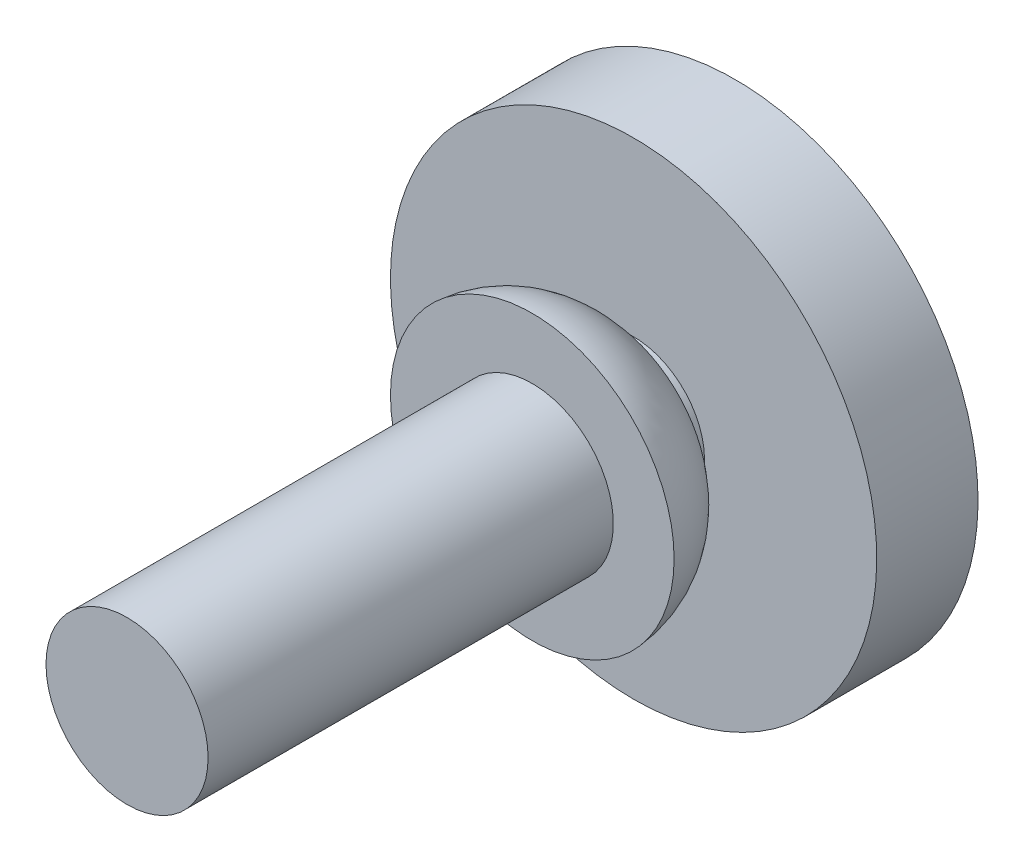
ISO-10303-21;
HEADER;
FILE_DESCRIPTION(('STEP AP214'),'2;1');
FILE_NAME('part.step','',(''),(''),'','','');
FILE_SCHEMA(('AUTOMOTIVE_DESIGN { 1 0 10303 214 1 1 1 1 }'));
ENDSEC;
DATA;
#1=APPLICATION_CONTEXT('core data for automotive mechanical design processes');
#2=APPLICATION_PROTOCOL_DEFINITION('international standard','automotive_design',2000,#1);
#3=PRODUCT_CONTEXT('',#1,'mechanical');
#4=PRODUCT('Part','Part','',(#3));
#5=PRODUCT_RELATED_PRODUCT_CATEGORY('part','',(#4));
#6=PRODUCT_DEFINITION_FORMATION('','',#4);
#7=PRODUCT_DEFINITION_CONTEXT('part definition',#1,'design');
#8=PRODUCT_DEFINITION('design','',#6,#7);
#9=PRODUCT_DEFINITION_SHAPE('','',#8);
#10=(LENGTH_UNIT() NAMED_UNIT(*) SI_UNIT(.MILLI.,.METRE.));
#11=(NAMED_UNIT(*) PLANE_ANGLE_UNIT() SI_UNIT($,.RADIAN.));
#12=(NAMED_UNIT(*) SI_UNIT($,.STERADIAN.) SOLID_ANGLE_UNIT());
#13=UNCERTAINTY_MEASURE_WITH_UNIT(LENGTH_MEASURE(1.E-05),#10,'distance_accuracy_value','');
#14=(GEOMETRIC_REPRESENTATION_CONTEXT(3) GLOBAL_UNCERTAINTY_ASSIGNED_CONTEXT((#13)) GLOBAL_UNIT_ASSIGNED_CONTEXT((#10,
#11,#12)) REPRESENTATION_CONTEXT('',''));
#15=CARTESIAN_POINT('',(0.,0.,0.));
#16=DIRECTION('',(0.,0.,1.));
#17=DIRECTION('',(1.,0.,0.));
#18=AXIS2_PLACEMENT_3D('',#15,#16,#17);
#19=CARTESIAN_POINT('',(0.,0.,-24.6259196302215));
#20=DIRECTION('',(0.,0.,1.));
#21=DIRECTION('',(1.,0.,0.));
#22=AXIS2_PLACEMENT_3D('',#19,#20,#21);
#23=DEGENERATE_TOROIDAL_SURFACE('',#22,2.0140132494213,5.,.T.);
#24=CARTESIAN_POINT('',(0.,0.,-25.));
#25=DIRECTION('',(0.,0.,1.));
#26=DIRECTION('',(1.,0.,0.));
#27=AXIS2_PLACEMENT_3D('',#24,#25,#26);
#28=CIRCLE('',#27,7.);
#29=CARTESIAN_POINT('',(7.,0.,-25.));
#30=VERTEX_POINT('',#29);
#31=EDGE_CURVE('E22',#30,#30,#28,.T.);
#32=ORIENTED_EDGE('',*,*,#31,.F.);
#33=EDGE_LOOP('',(#32));
#34=FACE_BOUND('',#33,.T.);
#35=CARTESIAN_POINT('',(0.,0.,-29.4));
#36=DIRECTION('',(0.,0.,-1.));
#37=DIRECTION('',(-1.,0.,0.));
#38=AXIS2_PLACEMENT_3D('',#35,#36,#37);
#39=CIRCLE('',#38,3.5);
#40=CARTESIAN_POINT('',(-3.5,0.,-29.4));
#41=VERTEX_POINT('',#40);
#42=EDGE_CURVE('E30',#41,#41,#39,.T.);
#43=ORIENTED_EDGE('',*,*,#42,.F.);
#44=EDGE_LOOP('',(#43));
#45=FACE_BOUND('',#44,.T.);
#46=ADVANCED_FACE('F15',(#34,#45),#23,.T.);
#47=CARTESIAN_POINT('',(-7.,0.,-25.));
#48=DIRECTION('',(0.,0.,-1.));
#49=DIRECTION('',(-1.,0.,0.));
#50=AXIS2_PLACEMENT_3D('',#47,#48,#49);
#51=PLANE('',#50);
#52=CARTESIAN_POINT('',(0.,0.,-25.));
#53=DIRECTION('',(0.,0.,-1.));
#54=DIRECTION('',(-1.,0.,0.));
#55=AXIS2_PLACEMENT_3D('',#52,#53,#54);
#56=CIRCLE('',#55,4.);
#57=CARTESIAN_POINT('',(-4.,0.,-25.));
#58=VERTEX_POINT('',#57);
#59=EDGE_CURVE('E10',#58,#58,#56,.F.);
#60=ORIENTED_EDGE('',*,*,#59,.F.);
#61=EDGE_LOOP('',(#60));
#62=FACE_BOUND('',#61,.T.);
#63=ORIENTED_EDGE('',*,*,#31,.T.);
#64=EDGE_LOOP('',(#63));
#65=FACE_BOUND('',#64,.T.);
#66=ADVANCED_FACE('F70',(#62,#65),#51,.F.);
#67=CARTESIAN_POINT('',(0.,0.,-5.));
#68=DIRECTION('',(0.,0.,-1.));
#69=DIRECTION('',(-1.,0.,0.));
#70=AXIS2_PLACEMENT_3D('',#67,#68,#69);
#71=CYLINDRICAL_SURFACE('',#70,4.);
#72=CARTESIAN_POINT('',(0.,0.,-5.));
#73=DIRECTION('',(0.,0.,1.));
#74=DIRECTION('',(1.,0.,0.));
#75=AXIS2_PLACEMENT_3D('',#72,#73,#74);
#76=CIRCLE('',#75,4.);
#77=CARTESIAN_POINT('',(4.,0.,-5.));
#78=VERTEX_POINT('',#77);
#79=EDGE_CURVE('E26',#78,#78,#76,.T.);
#80=ORIENTED_EDGE('',*,*,#79,.F.);
#81=EDGE_LOOP('',(#80));
#82=FACE_BOUND('',#81,.T.);
#83=ORIENTED_EDGE('',*,*,#59,.T.);
#84=EDGE_LOOP('',(#83));
#85=FACE_BOUND('',#84,.T.);
#86=ADVANCED_FACE('F76',(#82,#85),#71,.T.);
#87=CARTESIAN_POINT('',(0.,0.,-5.));
#88=DIRECTION('',(0.,0.,1.));
#89=DIRECTION('',(1.,0.,0.));
#90=AXIS2_PLACEMENT_3D('',#87,#88,#89);
#91=PLANE('',#90);
#92=ORIENTED_EDGE('',*,*,#79,.T.);
#93=EDGE_LOOP('',(#92));
#94=FACE_BOUND('',#93,.T.);
#95=ADVANCED_FACE('F83',(#94),#91,.T.);
#96=CARTESIAN_POINT('',(0.,0.,-39.8994949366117));
#97=DIRECTION('',(0.,0.,1.));
#98=DIRECTION('',(1.,0.,0.));
#99=AXIS2_PLACEMENT_3D('',#96,#97,#98);
#100=CYLINDRICAL_SURFACE('',#99,3.5);
#101=CARTESIAN_POINT('',(0.,0.,-30.));
#102=DIRECTION('',(0.,0.,1.));
#103=DIRECTION('',(1.,0.,0.));
#104=AXIS2_PLACEMENT_3D('',#101,#102,#103);
#105=CIRCLE('',#104,3.5);
#106=CARTESIAN_POINT('',(3.5,0.,-30.));
#107=VERTEX_POINT('',#106);
#108=EDGE_CURVE('E33',#107,#107,#105,.T.);
#109=ORIENTED_EDGE('',*,*,#108,.T.);
#110=EDGE_LOOP('',(#109));
#111=FACE_BOUND('',#110,.T.);
#112=ORIENTED_EDGE('',*,*,#42,.T.);
#113=EDGE_LOOP('',(#112));
#114=FACE_BOUND('',#113,.T.);
#115=ADVANCED_FACE('F87',(#111,#114),#100,.T.);
#116=CARTESIAN_POINT('',(0.,0.,-30.));
#117=DIRECTION('',(0.,0.,-1.));
#118=DIRECTION('',(0.,1.,0.));
#119=AXIS2_PLACEMENT_3D('',#116,#117,#118);
#120=CYLINDRICAL_SURFACE('',#119,12.);
#121=CARTESIAN_POINT('',(0.,0.,-30.));
#122=DIRECTION('',(0.,0.,1.));
#123=DIRECTION('',(0.,-1.,0.));
#124=AXIS2_PLACEMENT_3D('',#121,#122,#123);
#125=CIRCLE('',#124,12.);
#126=CARTESIAN_POINT('',(0.,-12.,-30.));
#127=VERTEX_POINT('',#126);
#128=EDGE_CURVE('E45',#127,#127,#125,.T.);
#129=ORIENTED_EDGE('',*,*,#128,.F.);
#130=EDGE_LOOP('',(#129));
#131=FACE_BOUND('',#130,.T.);
#132=CARTESIAN_POINT('',(0.,0.,-35.));
#133=DIRECTION('',(0.,0.,1.));
#134=DIRECTION('',(0.,-1.,0.));
#135=AXIS2_PLACEMENT_3D('',#132,#133,#134);
#136=CIRCLE('',#135,12.);
#137=CARTESIAN_POINT('',(0.,-12.,-35.));
#138=VERTEX_POINT('',#137);
#139=EDGE_CURVE('E44',#138,#138,#136,.T.);
#140=ORIENTED_EDGE('',*,*,#139,.T.);
#141=EDGE_LOOP('',(#140));
#142=FACE_BOUND('',#141,.T.);
#143=ADVANCED_FACE('F51',(#131,#142),#120,.T.);
#144=CARTESIAN_POINT('',(0.,0.,-30.));
#145=DIRECTION('',(0.,0.,1.));
#146=DIRECTION('',(0.,-1.,0.));
#147=AXIS2_PLACEMENT_3D('',#144,#145,#146);
#148=PLANE('',#147);
#149=ORIENTED_EDGE('',*,*,#108,.F.);
#150=EDGE_LOOP('',(#149));
#151=FACE_BOUND('',#150,.T.);
#152=ORIENTED_EDGE('',*,*,#128,.T.);
#153=EDGE_LOOP('',(#152));
#154=FACE_BOUND('',#153,.T.);
#155=ADVANCED_FACE('F55',(#151,#154),#148,.T.);
#156=CARTESIAN_POINT('',(0.,0.,-35.));
#157=DIRECTION('',(0.,0.,1.));
#158=DIRECTION('',(0.,-1.,0.));
#159=AXIS2_PLACEMENT_3D('',#156,#157,#158);
#160=PLANE('',#159);
#161=CARTESIAN_POINT('',(0.,0.,-35.));
#162=DIRECTION('',(0.,0.,1.));
#163=DIRECTION('',(0.,-1.,0.));
#164=AXIS2_PLACEMENT_3D('',#161,#162,#163);
#165=CIRCLE('',#164,3.);
#166=CARTESIAN_POINT('',(0.,-3.,-35.));
#167=VERTEX_POINT('',#166);
#168=EDGE_CURVE('E37',#167,#167,#165,.T.);
#169=ORIENTED_EDGE('',*,*,#168,.T.);
#170=EDGE_LOOP('',(#169));
#171=FACE_BOUND('',#170,.T.);
#172=ORIENTED_EDGE('',*,*,#139,.F.);
#173=EDGE_LOOP('',(#172));
#174=FACE_BOUND('',#173,.T.);
#175=ADVANCED_FACE('F53',(#171,#174),#160,.F.);
#176=CARTESIAN_POINT('',(0.,0.,-29.4));
#177=DIRECTION('',(0.,0.,1.));
#178=DIRECTION('',(1.,0.,0.));
#179=AXIS2_PLACEMENT_3D('',#176,#177,#178);
#180=PLANE('',#179);
#181=CARTESIAN_POINT('',(0.,0.,-29.4));
#182=DIRECTION('',(0.,0.,-1.));
#183=DIRECTION('',(-1.,0.,0.));
#184=AXIS2_PLACEMENT_3D('',#181,#182,#183);
#185=CIRCLE('',#184,3.);
#186=CARTESIAN_POINT('',(-3.,0.,-29.4));
#187=VERTEX_POINT('',#186);
#188=EDGE_CURVE('E36',#187,#187,#185,.T.);
#189=ORIENTED_EDGE('',*,*,#188,.T.);
#190=EDGE_LOOP('',(#189));
#191=FACE_BOUND('',#190,.T.);
#192=ADVANCED_FACE('F17',(#191),#180,.F.);
#193=CARTESIAN_POINT('',(0.,0.,-39.8994949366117));
#194=DIRECTION('',(0.,0.,1.));
#195=DIRECTION('',(1.,0.,0.));
#196=AXIS2_PLACEMENT_3D('',#193,#194,#195);
#197=CYLINDRICAL_SURFACE('',#196,3.);
#198=ORIENTED_EDGE('',*,*,#188,.F.);
#199=EDGE_LOOP('',(#198));
#200=FACE_BOUND('',#199,.T.);
#201=ORIENTED_EDGE('',*,*,#168,.F.);
#202=EDGE_LOOP('',(#201));
#203=FACE_BOUND('',#202,.T.);
#204=ADVANCED_FACE('F64',(#200,#203),#197,.F.);
#205=CLOSED_SHELL('',(#46,#66,#86,#95,#115,#143,#155,#175,#192,#204));
#206=MANIFOLD_SOLID_BREP('B1',#205);
#207=ADVANCED_BREP_SHAPE_REPRESENTATION('',(#18,#206),#14);
#208=SHAPE_DEFINITION_REPRESENTATION(#9,#207);
ENDSEC;
END-ISO-10303-21;
